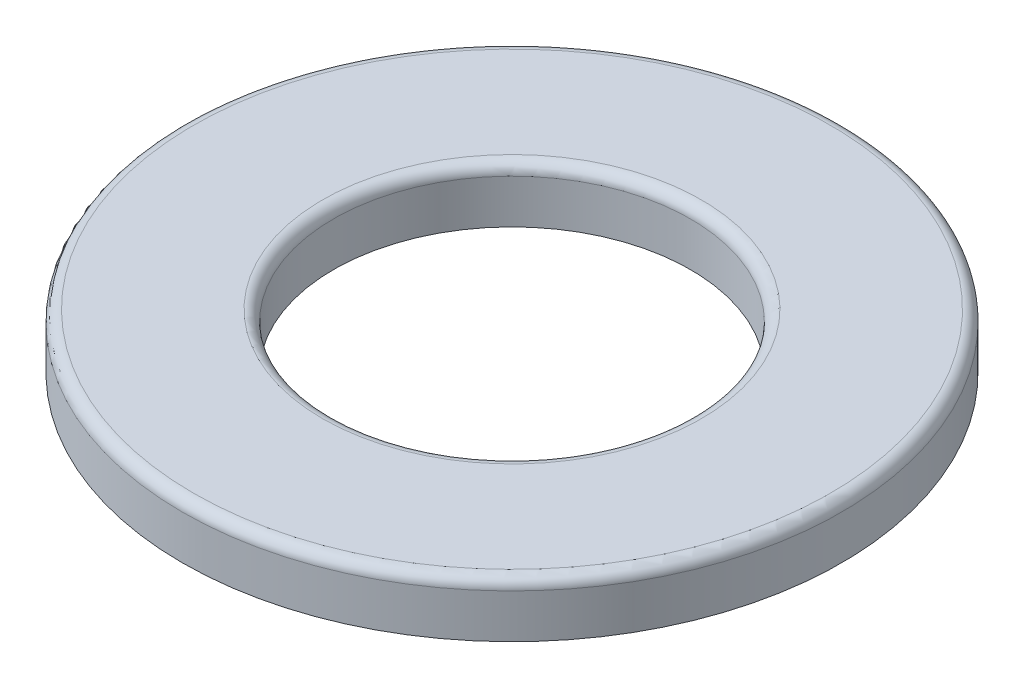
from build123d import *

# Parameters (mm, degrees)
SKETCH_1_R      = 6
SKETCH_1_R_2    = 3.25
EXTRUDE_1_DEPTH = 0.5
FILLET_1_R      = 0.2


with BuildPart() as part:
    # Sketch 1 → Extrude 1 (new, symmetric)
    with BuildSketch(Plane(origin=(0, 0, 0), x_dir=(1, 0, 0), z_dir=(0, 1, 0))):
        with Locations(Location((0, 0, 0), (0, 0, 270))):
            Circle(SKETCH_1_R)
        with Locations(Location((0, 0, 0), (0, 0, 270))):
            Circle(SKETCH_1_R_2, mode=Mode.SUBTRACT)
    extrude(amount=EXTRUDE_1_DEPTH, both=True)

    # Fillet 1
    fillet_1_edges = [part.edges().sort_by_distance(p)[0] for p in [
        (0, 0.5, -6),
        (0, 0.5, -3.25),
    ]]
    fillet(fillet_1_edges, radius=FILLET_1_R)


solid = part.part
